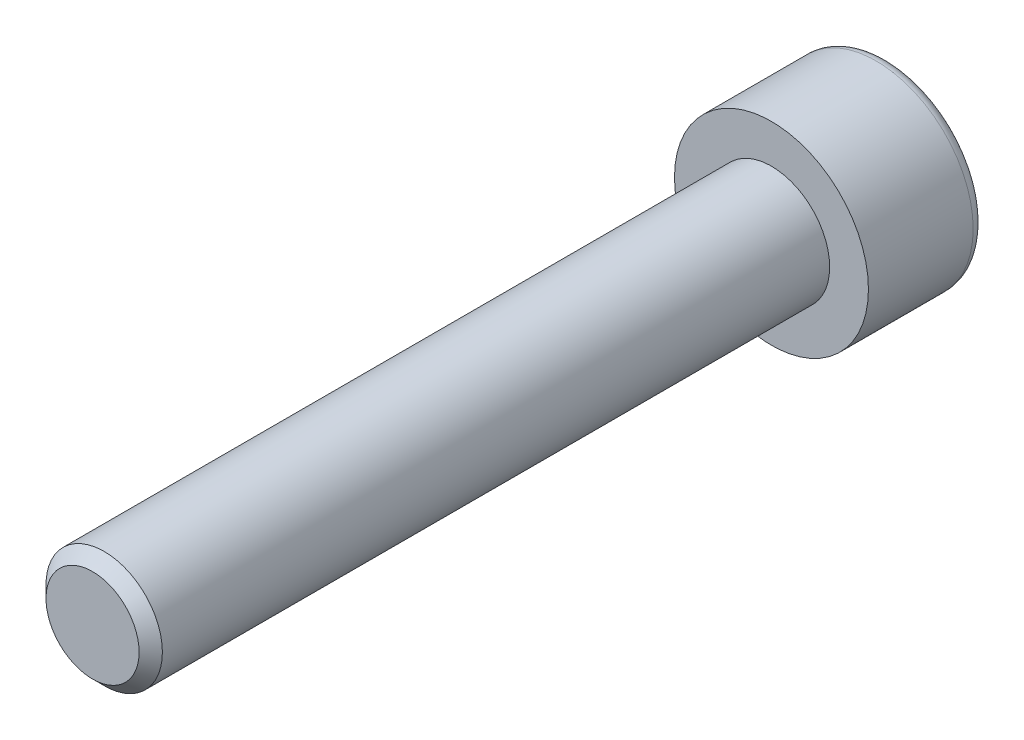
ISO-10303-21;
HEADER;
FILE_DESCRIPTION(('STEP AP214'),'2;1');
FILE_NAME('part.step','',(''),(''),'','','');
FILE_SCHEMA(('AUTOMOTIVE_DESIGN { 1 0 10303 214 1 1 1 1 }'));
ENDSEC;
DATA;
#1=APPLICATION_CONTEXT('core data for automotive mechanical design processes');
#2=APPLICATION_PROTOCOL_DEFINITION('international standard','automotive_design',2000,#1);
#3=PRODUCT_CONTEXT('',#1,'mechanical');
#4=PRODUCT('Part','Part','',(#3));
#5=PRODUCT_RELATED_PRODUCT_CATEGORY('part','',(#4));
#6=PRODUCT_DEFINITION_FORMATION('','',#4);
#7=PRODUCT_DEFINITION_CONTEXT('part definition',#1,'design');
#8=PRODUCT_DEFINITION('design','',#6,#7);
#9=PRODUCT_DEFINITION_SHAPE('','',#8);
#10=(LENGTH_UNIT() NAMED_UNIT(*) SI_UNIT(.MILLI.,.METRE.));
#11=(NAMED_UNIT(*) PLANE_ANGLE_UNIT() SI_UNIT($,.RADIAN.));
#12=(NAMED_UNIT(*) SI_UNIT($,.STERADIAN.) SOLID_ANGLE_UNIT());
#13=UNCERTAINTY_MEASURE_WITH_UNIT(LENGTH_MEASURE(1.E-05),#10,'distance_accuracy_value','');
#14=(GEOMETRIC_REPRESENTATION_CONTEXT(3) GLOBAL_UNCERTAINTY_ASSIGNED_CONTEXT((#13)) GLOBAL_UNIT_ASSIGNED_CONTEXT((#10,
#11,#12)) REPRESENTATION_CONTEXT('',''));
#15=CARTESIAN_POINT('',(0.,0.,0.));
#16=DIRECTION('',(0.,0.,1.));
#17=DIRECTION('',(1.,0.,0.));
#18=AXIS2_PLACEMENT_3D('',#15,#16,#17);
#19=CARTESIAN_POINT('',(0.,0.,-6.));
#20=DIRECTION('',(0.,0.,1.));
#21=DIRECTION('',(1.,0.,0.));
#22=AXIS2_PLACEMENT_3D('',#19,#20,#21);
#23=PLANE('',#22);
#24=CARTESIAN_POINT('',(0.,0.,-6.));
#25=DIRECTION('',(0.,0.,-1.));
#26=DIRECTION('',(-1.,0.,0.));
#27=AXIS2_PLACEMENT_3D('',#24,#25,#26);
#28=CIRCLE('',#27,4.4);
#29=CARTESIAN_POINT('',(-4.4,0.,-6.));
#30=VERTEX_POINT('',#29);
#31=EDGE_CURVE('E144',#30,#30,#28,.T.);
#32=ORIENTED_EDGE('',*,*,#31,.T.);
#33=EDGE_LOOP('',(#32));
#34=FACE_BOUND('',#33,.T.);
#35=DIRECTION('',(-0.86602540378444,0.499999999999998,0.));
#36=VECTOR('',#35,1.);
#37=CARTESIAN_POINT('',(0.,2.88675134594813,-6.));
#38=LINE('',#37,#36);
#39=CARTESIAN_POINT('',(2.5,1.44337567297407,-6.));
#40=VERTEX_POINT('',#39);
#41=CARTESIAN_POINT('',(0.,2.88675134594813,-6.));
#42=VERTEX_POINT('',#41);
#43=EDGE_CURVE('E46',#40,#42,#38,.T.);
#44=ORIENTED_EDGE('',*,*,#43,.T.);
#45=DIRECTION('',(-0.866025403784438,-0.500000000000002,0.));
#46=VECTOR('',#45,1.);
#47=CARTESIAN_POINT('',(0.,2.88675134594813,-6.));
#48=LINE('',#47,#46);
#49=CARTESIAN_POINT('',(-2.5,1.44337567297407,-6.));
#50=VERTEX_POINT('',#49);
#51=EDGE_CURVE('E117',#42,#50,#48,.T.);
#52=ORIENTED_EDGE('',*,*,#51,.T.);
#53=DIRECTION('',(0.,-1.,0.));
#54=VECTOR('',#53,1.);
#55=CARTESIAN_POINT('',(-2.5,-1.44337567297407,-6.));
#56=LINE('',#55,#54);
#57=CARTESIAN_POINT('',(-2.5,-1.44337567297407,-6.));
#58=VERTEX_POINT('',#57);
#59=EDGE_CURVE('E121',#50,#58,#56,.T.);
#60=ORIENTED_EDGE('',*,*,#59,.T.);
#61=DIRECTION('',(0.866025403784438,-0.500000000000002,0.));
#62=VECTOR('',#61,1.);
#63=CARTESIAN_POINT('',(0.,-2.88675134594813,-6.));
#64=LINE('',#63,#62);
#65=CARTESIAN_POINT('',(0.,-2.88675134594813,-6.));
#66=VERTEX_POINT('',#65);
#67=EDGE_CURVE('E124',#58,#66,#64,.T.);
#68=ORIENTED_EDGE('',*,*,#67,.T.);
#69=DIRECTION('',(0.86602540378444,0.499999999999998,0.));
#70=VECTOR('',#69,1.);
#71=CARTESIAN_POINT('',(0.,-2.88675134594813,-6.));
#72=LINE('',#71,#70);
#73=CARTESIAN_POINT('',(2.5,-1.44337567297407,-6.));
#74=VERTEX_POINT('',#73);
#75=EDGE_CURVE('E107',#66,#74,#72,.T.);
#76=ORIENTED_EDGE('',*,*,#75,.T.);
#77=DIRECTION('',(0.,1.,0.));
#78=VECTOR('',#77,1.);
#79=CARTESIAN_POINT('',(2.5,-1.44337567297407,-6.));
#80=LINE('',#79,#78);
#81=EDGE_CURVE('E127',#74,#40,#80,.T.);
#82=ORIENTED_EDGE('',*,*,#81,.T.);
#83=EDGE_LOOP('',(#44,#52,#60,#68,#76,#82));
#84=FACE_BOUND('',#83,.T.);
#85=ADVANCED_FACE('F31',(#34,#84),#23,.F.);
#86=CARTESIAN_POINT('',(0.,0.,-5.4));
#87=DIRECTION('',(0.,0.,-1.));
#88=DIRECTION('',(-1.,0.,0.));
#89=AXIS2_PLACEMENT_3D('',#86,#87,#88);
#90=TOROIDAL_SURFACE('',#89,4.4,0.600000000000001);
#91=ORIENTED_EDGE('',*,*,#31,.F.);
#92=EDGE_LOOP('',(#91));
#93=FACE_BOUND('',#92,.T.);
#94=CARTESIAN_POINT('',(0.,0.,-5.4));
#95=DIRECTION('',(0.,0.,-1.));
#96=DIRECTION('',(-1.,0.,0.));
#97=AXIS2_PLACEMENT_3D('',#94,#95,#96);
#98=CIRCLE('',#97,5.);
#99=CARTESIAN_POINT('',(-5.,0.,-5.4));
#100=VERTEX_POINT('',#99);
#101=EDGE_CURVE('E141',#100,#100,#98,.T.);
#102=ORIENTED_EDGE('',*,*,#101,.T.);
#103=EDGE_LOOP('',(#102));
#104=FACE_BOUND('',#103,.T.);
#105=ADVANCED_FACE('F161',(#93,#104),#90,.T.);
#106=CARTESIAN_POINT('',(0.,0.,0.));
#107=DIRECTION('',(0.,0.,-1.));
#108=DIRECTION('',(-1.,0.,0.));
#109=AXIS2_PLACEMENT_3D('',#106,#107,#108);
#110=CYLINDRICAL_SURFACE('',#109,5.);
#111=ORIENTED_EDGE('',*,*,#101,.F.);
#112=EDGE_LOOP('',(#111));
#113=FACE_BOUND('',#112,.T.);
#114=CARTESIAN_POINT('',(0.,0.,0.));
#115=DIRECTION('',(0.,0.,-1.));
#116=DIRECTION('',(-1.,0.,0.));
#117=AXIS2_PLACEMENT_3D('',#114,#115,#116);
#118=CIRCLE('',#117,5.);
#119=CARTESIAN_POINT('',(-5.,0.,0.));
#120=VERTEX_POINT('',#119);
#121=EDGE_CURVE('E138',#120,#120,#118,.T.);
#122=ORIENTED_EDGE('',*,*,#121,.T.);
#123=EDGE_LOOP('',(#122));
#124=FACE_BOUND('',#123,.T.);
#125=ADVANCED_FACE('F166',(#113,#124),#110,.T.);
#126=CARTESIAN_POINT('',(0.,0.,0.));
#127=DIRECTION('',(0.,0.,-1.));
#128=DIRECTION('',(-1.,0.,0.));
#129=AXIS2_PLACEMENT_3D('',#126,#127,#128);
#130=PLANE('',#129);
#131=CARTESIAN_POINT('',(0.,0.,0.));
#132=DIRECTION('',(0.,0.,1.));
#133=DIRECTION('',(1.,0.,0.));
#134=AXIS2_PLACEMENT_3D('',#131,#132,#133);
#135=CIRCLE('',#134,3.);
#136=CARTESIAN_POINT('',(3.,0.,0.));
#137=VERTEX_POINT('',#136);
#138=EDGE_CURVE('E118',#137,#137,#135,.T.);
#139=ORIENTED_EDGE('',*,*,#138,.F.);
#140=EDGE_LOOP('',(#139));
#141=FACE_BOUND('',#140,.T.);
#142=ORIENTED_EDGE('',*,*,#121,.F.);
#143=EDGE_LOOP('',(#142));
#144=FACE_BOUND('',#143,.T.);
#145=ADVANCED_FACE('F173',(#141,#144),#130,.F.);
#146=CARTESIAN_POINT('',(0.,2.88675134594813,-3.));
#147=DIRECTION('',(-0.499999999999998,-0.86602540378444,0.));
#148=DIRECTION('',(0.86602540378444,-0.499999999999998,0.));
#149=AXIS2_PLACEMENT_3D('',#146,#147,#148);
#150=PLANE('',#149);
#151=ORIENTED_EDGE('',*,*,#43,.F.);
#152=DIRECTION('',(0.,0.,-1.));
#153=VECTOR('',#152,1.);
#154=CARTESIAN_POINT('',(2.5,1.44337567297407,-3.));
#155=LINE('',#154,#153);
#156=CARTESIAN_POINT('',(2.5,1.44337567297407,-3.));
#157=VERTEX_POINT('',#156);
#158=EDGE_CURVE('E112',#157,#40,#155,.T.);
#159=ORIENTED_EDGE('',*,*,#158,.F.);
#160=DIRECTION('',(-0.86602540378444,0.499999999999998,0.));
#161=VECTOR('',#160,1.);
#162=CARTESIAN_POINT('',(0.,2.88675134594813,-3.));
#163=LINE('',#162,#161);
#164=CARTESIAN_POINT('',(0.,2.88675134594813,-3.));
#165=VERTEX_POINT('',#164);
#166=EDGE_CURVE('E130',#157,#165,#163,.T.);
#167=ORIENTED_EDGE('',*,*,#166,.T.);
#168=DIRECTION('',(0.,0.,-1.));
#169=VECTOR('',#168,1.);
#170=CARTESIAN_POINT('',(0.,2.88675134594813,-3.));
#171=LINE('',#170,#169);
#172=EDGE_CURVE('E136',#165,#42,#171,.T.);
#173=ORIENTED_EDGE('',*,*,#172,.T.);
#174=EDGE_LOOP('',(#151,#159,#167,#173));
#175=FACE_BOUND('',#174,.T.);
#176=ADVANCED_FACE('F177',(#175),#150,.T.);
#177=CARTESIAN_POINT('',(0.,2.88675134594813,-3.));
#178=DIRECTION('',(0.500000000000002,-0.866025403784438,0.));
#179=DIRECTION('',(0.866025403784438,0.500000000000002,0.));
#180=AXIS2_PLACEMENT_3D('',#177,#178,#179);
#181=PLANE('',#180);
#182=ORIENTED_EDGE('',*,*,#51,.F.);
#183=ORIENTED_EDGE('',*,*,#172,.F.);
#184=DIRECTION('',(-0.866025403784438,-0.500000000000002,0.));
#185=VECTOR('',#184,1.);
#186=CARTESIAN_POINT('',(0.,2.88675134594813,-3.));
#187=LINE('',#186,#185);
#188=CARTESIAN_POINT('',(-2.5,1.44337567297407,-3.));
#189=VERTEX_POINT('',#188);
#190=EDGE_CURVE('E85',#165,#189,#187,.T.);
#191=ORIENTED_EDGE('',*,*,#190,.T.);
#192=DIRECTION('',(0.,0.,-1.));
#193=VECTOR('',#192,1.);
#194=CARTESIAN_POINT('',(-2.5,1.44337567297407,-3.));
#195=LINE('',#194,#193);
#196=EDGE_CURVE('E134',#189,#50,#195,.T.);
#197=ORIENTED_EDGE('',*,*,#196,.T.);
#198=EDGE_LOOP('',(#182,#183,#191,#197));
#199=FACE_BOUND('',#198,.T.);
#200=ADVANCED_FACE('F181',(#199),#181,.T.);
#201=CARTESIAN_POINT('',(-2.5,-1.44337567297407,-3.));
#202=DIRECTION('',(1.,0.,0.));
#203=DIRECTION('',(0.,0.,-1.));
#204=AXIS2_PLACEMENT_3D('',#201,#202,#203);
#205=PLANE('',#204);
#206=ORIENTED_EDGE('',*,*,#59,.F.);
#207=ORIENTED_EDGE('',*,*,#196,.F.);
#208=DIRECTION('',(0.,-1.,0.));
#209=VECTOR('',#208,1.);
#210=CARTESIAN_POINT('',(-2.5,-1.44337567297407,-3.));
#211=LINE('',#210,#209);
#212=CARTESIAN_POINT('',(-2.5,-1.44337567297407,-3.));
#213=VERTEX_POINT('',#212);
#214=EDGE_CURVE('E103',#189,#213,#211,.T.);
#215=ORIENTED_EDGE('',*,*,#214,.T.);
#216=DIRECTION('',(0.,0.,-1.));
#217=VECTOR('',#216,1.);
#218=CARTESIAN_POINT('',(-2.5,-1.44337567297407,-3.));
#219=LINE('',#218,#217);
#220=EDGE_CURVE('E100',#213,#58,#219,.T.);
#221=ORIENTED_EDGE('',*,*,#220,.T.);
#222=EDGE_LOOP('',(#206,#207,#215,#221));
#223=FACE_BOUND('',#222,.T.);
#224=ADVANCED_FACE('F184',(#223),#205,.T.);
#225=CARTESIAN_POINT('',(0.,-2.88675134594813,-3.));
#226=DIRECTION('',(0.500000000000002,0.866025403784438,0.));
#227=DIRECTION('',(-0.866025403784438,0.500000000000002,0.));
#228=AXIS2_PLACEMENT_3D('',#225,#226,#227);
#229=PLANE('',#228);
#230=ORIENTED_EDGE('',*,*,#67,.F.);
#231=ORIENTED_EDGE('',*,*,#220,.F.);
#232=DIRECTION('',(0.866025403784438,-0.500000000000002,0.));
#233=VECTOR('',#232,1.);
#234=CARTESIAN_POINT('',(0.,-2.88675134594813,-3.));
#235=LINE('',#234,#233);
#236=CARTESIAN_POINT('',(0.,-2.88675134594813,-3.));
#237=VERTEX_POINT('',#236);
#238=EDGE_CURVE('E95',#213,#237,#235,.T.);
#239=ORIENTED_EDGE('',*,*,#238,.T.);
#240=DIRECTION('',(0.,0.,-1.));
#241=VECTOR('',#240,1.);
#242=CARTESIAN_POINT('',(0.,-2.88675134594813,-3.));
#243=LINE('',#242,#241);
#244=EDGE_CURVE('E99',#237,#66,#243,.T.);
#245=ORIENTED_EDGE('',*,*,#244,.T.);
#246=EDGE_LOOP('',(#230,#231,#239,#245));
#247=FACE_BOUND('',#246,.T.);
#248=ADVANCED_FACE('F98',(#247),#229,.T.);
#249=CARTESIAN_POINT('',(0.,-2.88675134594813,-3.));
#250=DIRECTION('',(-0.499999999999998,0.86602540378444,0.));
#251=DIRECTION('',(-0.86602540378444,-0.499999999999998,0.));
#252=AXIS2_PLACEMENT_3D('',#249,#250,#251);
#253=PLANE('',#252);
#254=ORIENTED_EDGE('',*,*,#75,.F.);
#255=ORIENTED_EDGE('',*,*,#244,.F.);
#256=DIRECTION('',(0.86602540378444,0.499999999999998,0.));
#257=VECTOR('',#256,1.);
#258=CARTESIAN_POINT('',(0.,-2.88675134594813,-3.));
#259=LINE('',#258,#257);
#260=CARTESIAN_POINT('',(2.5,-1.44337567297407,-3.));
#261=VERTEX_POINT('',#260);
#262=EDGE_CURVE('E102',#237,#261,#259,.T.);
#263=ORIENTED_EDGE('',*,*,#262,.T.);
#264=DIRECTION('',(0.,0.,-1.));
#265=VECTOR('',#264,1.);
#266=CARTESIAN_POINT('',(2.5,-1.44337567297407,-3.));
#267=LINE('',#266,#265);
#268=EDGE_CURVE('E76',#261,#74,#267,.T.);
#269=ORIENTED_EDGE('',*,*,#268,.T.);
#270=EDGE_LOOP('',(#254,#255,#263,#269));
#271=FACE_BOUND('',#270,.T.);
#272=ADVANCED_FACE('F105',(#271),#253,.T.);
#273=CARTESIAN_POINT('',(2.5,-1.44337567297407,-3.));
#274=DIRECTION('',(-1.,0.,0.));
#275=DIRECTION('',(0.,0.,1.));
#276=AXIS2_PLACEMENT_3D('',#273,#274,#275);
#277=PLANE('',#276);
#278=ORIENTED_EDGE('',*,*,#81,.F.);
#279=ORIENTED_EDGE('',*,*,#268,.F.);
#280=DIRECTION('',(0.,1.,0.));
#281=VECTOR('',#280,1.);
#282=CARTESIAN_POINT('',(2.5,-1.44337567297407,-3.));
#283=LINE('',#282,#281);
#284=EDGE_CURVE('E54',#261,#157,#283,.T.);
#285=ORIENTED_EDGE('',*,*,#284,.T.);
#286=ORIENTED_EDGE('',*,*,#158,.T.);
#287=EDGE_LOOP('',(#278,#279,#285,#286));
#288=FACE_BOUND('',#287,.T.);
#289=ADVANCED_FACE('F193',(#288),#277,.T.);
#290=CARTESIAN_POINT('',(2.5,1.44337567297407,-3.));
#291=DIRECTION('',(0.,0.,1.));
#292=DIRECTION('',(1.,0.,0.));
#293=AXIS2_PLACEMENT_3D('',#290,#291,#292);
#294=PLANE('',#293);
#295=ORIENTED_EDGE('',*,*,#166,.F.);
#296=ORIENTED_EDGE('',*,*,#284,.F.);
#297=ORIENTED_EDGE('',*,*,#262,.F.);
#298=ORIENTED_EDGE('',*,*,#238,.F.);
#299=ORIENTED_EDGE('',*,*,#214,.F.);
#300=ORIENTED_EDGE('',*,*,#190,.F.);
#301=EDGE_LOOP('',(#295,#296,#297,#298,#299,#300));
#302=FACE_BOUND('',#301,.T.);
#303=ADVANCED_FACE('F110',(#302),#294,.F.);
#304=CARTESIAN_POINT('',(0.,0.,35.));
#305=DIRECTION('',(0.,0.,1.));
#306=DIRECTION('',(1.,0.,0.));
#307=AXIS2_PLACEMENT_3D('',#304,#305,#306);
#308=PLANE('',#307);
#309=CARTESIAN_POINT('',(0.,0.,35.));
#310=DIRECTION('',(0.,0.,1.));
#311=DIRECTION('',(1.,0.,0.));
#312=AXIS2_PLACEMENT_3D('',#309,#310,#311);
#313=CIRCLE('',#312,2.4);
#314=CARTESIAN_POINT('',(2.4,0.,35.));
#315=VERTEX_POINT('',#314);
#316=EDGE_CURVE('E39',#315,#315,#313,.T.);
#317=ORIENTED_EDGE('',*,*,#316,.T.);
#318=EDGE_LOOP('',(#317));
#319=FACE_BOUND('',#318,.T.);
#320=ADVANCED_FACE('F149',(#319),#308,.T.);
#321=CARTESIAN_POINT('',(0.,0.,0.));
#322=DIRECTION('',(0.,0.,1.));
#323=DIRECTION('',(1.,0.,0.));
#324=AXIS2_PLACEMENT_3D('',#321,#322,#323);
#325=CYLINDRICAL_SURFACE('',#324,3.);
#326=CARTESIAN_POINT('',(0.,0.,34.4));
#327=DIRECTION('',(0.,0.,1.));
#328=DIRECTION('',(1.,0.,0.));
#329=AXIS2_PLACEMENT_3D('',#326,#327,#328);
#330=CIRCLE('',#329,3.);
#331=CARTESIAN_POINT('',(3.,0.,34.4));
#332=VERTEX_POINT('',#331);
#333=EDGE_CURVE('E11',#332,#332,#330,.F.);
#334=ORIENTED_EDGE('',*,*,#333,.T.);
#335=EDGE_LOOP('',(#334));
#336=FACE_BOUND('',#335,.T.);
#337=ORIENTED_EDGE('',*,*,#138,.T.);
#338=EDGE_LOOP('',(#337));
#339=FACE_BOUND('',#338,.T.);
#340=ADVANCED_FACE('F152',(#336,#339),#325,.T.);
#341=CARTESIAN_POINT('',(0.,0.,35.));
#342=DIRECTION('',(0.,0.,-1.));
#343=DIRECTION('',(-1.,0.,0.));
#344=AXIS2_PLACEMENT_3D('',#341,#342,#343);
#345=CONICAL_SURFACE('',#344,2.4,0.785398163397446);
#346=ORIENTED_EDGE('',*,*,#333,.F.);
#347=EDGE_LOOP('',(#346));
#348=FACE_BOUND('',#347,.T.);
#349=ORIENTED_EDGE('',*,*,#316,.F.);
#350=EDGE_LOOP('',(#349));
#351=FACE_BOUND('',#350,.T.);
#352=ADVANCED_FACE('F33',(#348,#351),#345,.T.);
#353=CLOSED_SHELL('',(#85,#105,#125,#145,#176,#200,#224,#248,#272,#289,#303,#320,#340,#352));
#354=MANIFOLD_SOLID_BREP('B2',#353);
#355=ADVANCED_BREP_SHAPE_REPRESENTATION('',(#18,#354),#14);
#356=SHAPE_DEFINITION_REPRESENTATION(#9,#355);
ENDSEC;
END-ISO-10303-21;
